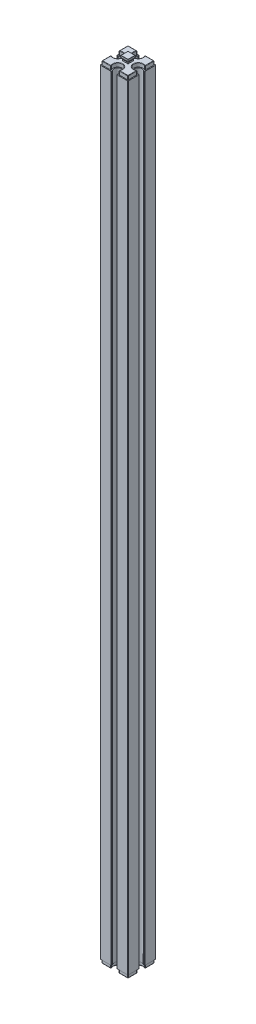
from build123d import *

# Parameters (mm, degrees)
EXTRUDE_1_DEPTH        = 208
EXTRUDE_2_DEPTH        = 2
EXTRUDE_3_DEPTH        = 2
FILLET_3_R             = 0.2
CUT_EXTRUDE_1_DEPTH    = 3
FILLET_4_R             = 0.2
FILLET_5_R             = 0.1
FILLET_3_OF_MIRROR_1_R = 0.2
FILLET_4_OF_MIRROR_1_R = 0.2
FILLET_5_OF_MIRROR_1_R = 0.1


with BuildPart() as part:
    # Sketch 1 → Extrude 1 (new body)
    with BuildSketch(Plane(origin=(0, 0, 0), x_dir=(1, 0, 0), z_dir=(0, 1, 0))):
        with BuildLine():
            Line((-7.5, 7.5), (-1.5, 7.5))
            Line((-1.5, 7.5), (-1.5, 6.822875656))
            ThreePointArc((-1.5, 6.822875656), (0, 3.5), (1.5, 6.822875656))
            Line((1.5, 6.822875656), (1.5, 7.5))
            Line((1.5, 7.5), (7.5, 7.5))
            Line((7.5, 7.5), (7.5, 1.5))
            Line((7.5, 1.5), (6.822875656, 1.5))
            ThreePointArc((6.822875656, 1.5), (3.5, 0), (6.822875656, -1.5))
            Line((6.822875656, -1.5), (7.5, -1.5))
            Line((7.5, -1.5), (7.5, -7.5))
            Line((7.5, -7.5), (1.5, -7.5))
            Line((1.5, -7.5), (1.5, -6.822875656))
            ThreePointArc((1.5, -6.822875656), (0, -3.5), (-1.5, -6.822875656))
            Line((-1.5, -6.822875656), (-1.5, -7.5))
            Line((-1.5, -7.5), (-7.5, -7.5))
            Line((-7.5, -7.5), (-7.5, -1.5))
            Line((-7.5, -1.5), (-6.822875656, -1.5))
            ThreePointArc((-6.822875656, -1.5), (-3.5, 0), (-6.822875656, 1.5))
            Line((-6.822875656, 1.5), (-7.5, 1.5))
            Line((-7.5, 1.5), (-7.5, 7.5))
        make_face()
    extrude_1 = extrude(amount=EXTRUDE_1_DEPTH)

    # Sketch 2 → Extrude 2 (add)
    with BuildSketch(Plane(origin=(0, 208, 0), x_dir=(1, 0, 0), z_dir=(0, 1, 0))):
        with BuildLine():
            Line((-7, 7), (-7, 2))
            ThreePointArc((-7, 2), (-3, 0), (-7, -2))
            Line((-7, -2), (-7, -7))
            Line((-7, -7), (-2, -7))
            ThreePointArc((-2, -7), (0, -3), (2, -7))
            Line((2, -7), (7, -7))
            Line((7, -7), (7, -2))
            ThreePointArc((7, -2), (3, 0), (7, 2))
            Line((7, 2), (7, 7))
            Line((7, 7), (2, 7))
            ThreePointArc((2, 7), (0, 3), (-2, 7))
            Line((-2, 7), (-7, 7))
        make_face()
    extrude_2 = extrude(amount=EXTRUDE_2_DEPTH)

    # Sketch 3 → Extrude 3 (add, symmetric)
    with BuildSketch(Plane(origin=(0, 0, 0), x_dir=(0, 0, -1), z_dir=(1, 0, 0))):
        with BuildLine():
            Line((-1.5, 210), (1.5, 210))
            Line((1.5, 210), (1.5, 210.677124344))
            ThreePointArc((1.5, 210.677124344), (1.780042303, 211.088161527), (1.95, 211.555590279))
            Line((1.95, 211.555590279), (1.95, 212.5))
            Line((1.95, 212.5), (-1.95, 212.5))
            Line((-1.95, 212.5), (-1.95, 211.555590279))
            ThreePointArc((-1.95, 211.555590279), (-1.780042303, 211.088161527), (-1.5, 210.677124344))
            Line((-1.5, 210.677124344), (-1.5, 210))
        make_face()
    extrude_3 = extrude(amount=EXTRUDE_3_DEPTH, both=True)

    # Fillet 3
    fillet_3_edges = [part.edges().sort_by_distance(p)[0] for p in [
        (-7.5, 104, -7.5),
        (-1.5, 104, -7.5),
        (1.5, 104, -7.5),
        (7.5, 104, -7.5),
        (7.5, 104, -1.5),
        (7.5, 104, 1.5),
        (7.5, 104, 7.5),
        (1.5, 104, 7.5),
        (-1.5, 104, 7.5),
        (-7.5, 104, 7.5),
        (-7.5, 104, 1.5),
        (-6.822875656, 104, -1.5),
        (-7.5, 104, -1.5),
    ]]
    fillet(fillet_3_edges, radius=FILLET_3_R)

    # Sketch 4 → Cut-Extrude 1 (cut, symmetric)
    with BuildSketch(Plane.XY):
        with BuildLine():
            Line((1.95, 212.5), (2, 212.5))
            Line((2, 212.5), (2, 210))
            Line((2, 210), (1.5, 210))
            Line((1.5, 210), (1.5, 210.677124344))
            ThreePointArc((1.5, 210.677124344), (1.780042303, 211.088161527), (1.95, 211.555590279))
            Line((1.95, 211.555590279), (1.95, 212.5))
        make_face()
        with BuildLine():
            Line((-1.95, 212.5), (-1.95, 211.555590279))
            ThreePointArc((-1.95, 211.555590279), (-1.780042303, 211.088161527), (-1.5, 210.677124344))
            Line((-1.5, 210.677124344), (-1.5, 210))
            Line((-1.5, 210), (-2, 210))
            Line((-2, 210), (-2, 212.5))
            Line((-2, 212.5), (-1.95, 212.5))
        make_face()
    cut_extrude_1 = extrude(amount=CUT_EXTRUDE_1_DEPTH, both=True, mode=Mode.SUBTRACT)

    # Fillet 4
    fillet_4_edges = [part.edges().sort_by_distance(p)[0] for p in [
        (-2, 209, -7),
        (-7, 209, -7),
        (-7, 209, -2),
        (-7, 209, 2),
        (-7, 209, 7),
        (-2, 209, 7),
        (2, 209, 7),
        (7, 209, 7),
        (7, 209, 2),
        (7, 209, -2),
        (7, 209, -7),
        (2, 209, -7),
        (-4.5, 210, -7),
        (-7, 210, -4.5),
        (-3, 210, 0),
        (-7, 210, 4.5),
        (-4.5, 210, 7),
        (0, 210, 3),
        (4.5, 210, 7),
        (7, 210, 4.5),
        (3, 210, 0),
        (7, 210, -4.5),
        (4.5, 210, -7),
        (0, 210, -3),
    ]]
    fillet(fillet_4_edges, radius=FILLET_4_R)

    # Fillet 5
    fillet_5_edges = [part.edges().sort_by_distance(p)[0] for p in [
        (1.95, 212.5, 0),
        (0, 212.5, -1.95),
        (0, 212.5, 1.95),
        (-1.95, 212.5, 0),
    ]]
    fillet(fillet_5_edges, radius=FILLET_5_R)

    # Mirror 1: Extrude 1, Extrude 2, Extrude 3, Cut-Extrude 1 across Top Plane
    add(extrude_1.mirror(Plane(origin=(0, 0, 0), x_dir=(1, 0, 0), z_dir=(0, 1, 0))))
    add(extrude_2.mirror(Plane(origin=(0, 0, 0), x_dir=(1, 0, 0), z_dir=(0, 1, 0))))
    add(extrude_3.mirror(Plane(origin=(0, 0, 0), x_dir=(1, 0, 0), z_dir=(0, 1, 0))))
    add(cut_extrude_1.mirror(Plane(origin=(0, 0, 0), x_dir=(1, 0, 0), z_dir=(0, 1, 0))), mode=Mode.SUBTRACT)

    # Fillet 3 of Mirror 1
    fillet_3_of_mirror_1_edges = [part.edges().sort_by_distance(p)[0] for p in [
        (-7.5, -104, -7.5),
        (-1.5, -104, -7.5),
        (1.5, -104, -7.5),
        (7.5, -104, -7.5),
        (7.5, -104, -1.5),
        (7.5, -104, 1.5),
        (7.5, -104, 7.5),
        (1.5, -104, 7.5),
        (-1.5, -104, 7.5),
        (-7.5, -104, 7.5),
        (-7.5, -104, 1.5),
        (-6.822875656, -104, -1.5),
        (-7.5, -104, -1.5),
    ]]
    fillet(fillet_3_of_mirror_1_edges, radius=FILLET_3_OF_MIRROR_1_R)

    # Fillet 4 of Mirror 1
    fillet_4_of_mirror_1_edges = [part.edges().sort_by_distance(p)[0] for p in [
        (-2, -209, -7),
        (-7, -209, -7),
        (-7, -209, -2),
        (-7, -209, 2),
        (-7, -209, 7),
        (-2, -209, 7),
        (2, -209, 7),
        (7, -209, 7),
        (7, -209, 2),
        (7, -209, -2),
        (7, -209, -7),
        (2, -209, -7),
        (-4.5, -210, -7),
        (-7, -210, -4.5),
        (-3, -210, 0),
        (-7, -210, 4.5),
        (-4.5, -210, 7),
        (0, -210, 3),
        (4.5, -210, 7),
        (7, -210, 4.5),
        (3, -210, 0),
        (7, -210, -4.5),
        (4.5, -210, -7),
        (0, -210, -3),
    ]]
    fillet(fillet_4_of_mirror_1_edges, radius=FILLET_4_OF_MIRROR_1_R)

    # Fillet 5 of Mirror 1
    fillet_5_of_mirror_1_edges = [part.edges().sort_by_distance(p)[0] for p in [
        (1.95, -212.5, 0),
        (0, -212.5, -1.95),
        (0, -212.5, 1.95),
        (-1.95, -212.5, 0),
    ]]
    fillet(fillet_5_of_mirror_1_edges, radius=FILLET_5_OF_MIRROR_1_R)


solid = part.part
